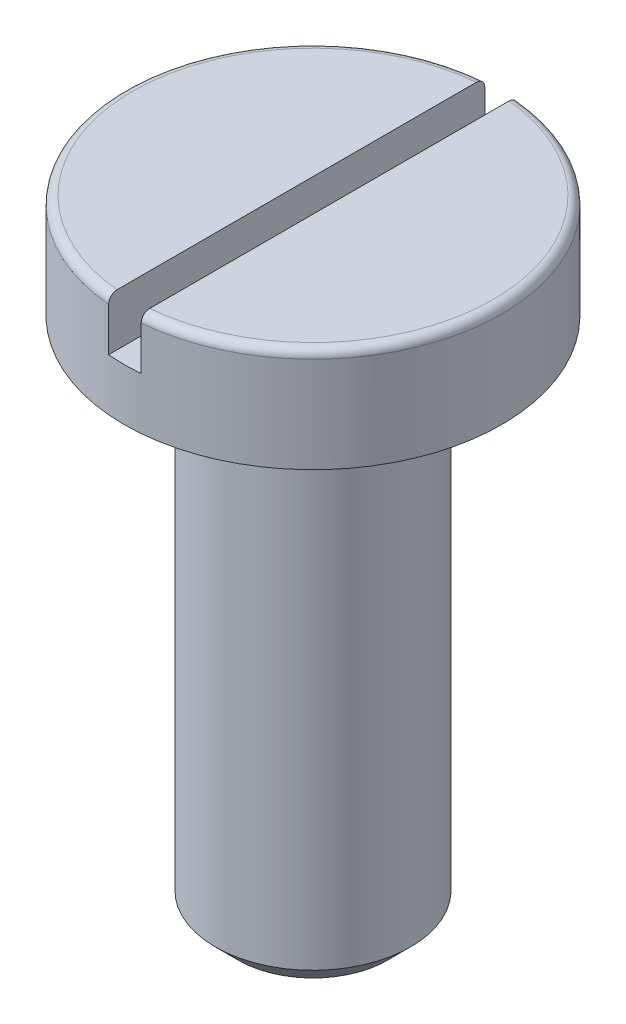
ISO-10303-21;
HEADER;
FILE_DESCRIPTION(('STEP AP214'),'2;1');
FILE_NAME('part.step','',(''),(''),'','','');
FILE_SCHEMA(('AUTOMOTIVE_DESIGN { 1 0 10303 214 1 1 1 1 }'));
ENDSEC;
DATA;
#1=APPLICATION_CONTEXT('core data for automotive mechanical design processes');
#2=APPLICATION_PROTOCOL_DEFINITION('international standard','automotive_design',2000,#1);
#3=PRODUCT_CONTEXT('',#1,'mechanical');
#4=PRODUCT('Part','Part','',(#3));
#5=PRODUCT_RELATED_PRODUCT_CATEGORY('part','',(#4));
#6=PRODUCT_DEFINITION_FORMATION('','',#4);
#7=PRODUCT_DEFINITION_CONTEXT('part definition',#1,'design');
#8=PRODUCT_DEFINITION('design','',#6,#7);
#9=PRODUCT_DEFINITION_SHAPE('','',#8);
#10=(LENGTH_UNIT() NAMED_UNIT(*) SI_UNIT(.MILLI.,.METRE.));
#11=(NAMED_UNIT(*) PLANE_ANGLE_UNIT() SI_UNIT($,.RADIAN.));
#12=(NAMED_UNIT(*) SI_UNIT($,.STERADIAN.) SOLID_ANGLE_UNIT());
#13=UNCERTAINTY_MEASURE_WITH_UNIT(LENGTH_MEASURE(1.E-05),#10,'distance_accuracy_value','');
#14=(GEOMETRIC_REPRESENTATION_CONTEXT(3) GLOBAL_UNCERTAINTY_ASSIGNED_CONTEXT((#13)) GLOBAL_UNIT_ASSIGNED_CONTEXT((#10,
#11,#12)) REPRESENTATION_CONTEXT('',''));
#15=CARTESIAN_POINT('',(0.,0.,0.));
#16=DIRECTION('',(0.,0.,1.));
#17=DIRECTION('',(1.,0.,0.));
#18=AXIS2_PLACEMENT_3D('',#15,#16,#17);
#19=CARTESIAN_POINT('',(0.,1.6,0.));
#20=DIRECTION('',(0.,-1.,0.));
#21=DIRECTION('',(0.,0.,-1.));
#22=AXIS2_PLACEMENT_3D('',#19,#20,#21);
#23=PLANE('',#22);
#24=CARTESIAN_POINT('',(0.,1.6,0.));
#25=DIRECTION('',(0.,1.,0.));
#26=DIRECTION('',(0.,0.,1.));
#27=AXIS2_PLACEMENT_3D('',#24,#25,#26);
#28=CIRCLE('',#27,2.77);
#29=CARTESIAN_POINT('',(-0.25,1.6,-2.75869534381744));
#30=VERTEX_POINT('',#29);
#31=CARTESIAN_POINT('',(-0.25,1.6,2.75869534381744));
#32=VERTEX_POINT('',#31);
#33=EDGE_CURVE('E96',#30,#32,#28,.T.);
#34=ORIENTED_EDGE('',*,*,#33,.T.);
#35=DIRECTION('',(0.,0.,1.));
#36=VECTOR('',#35,1.);
#37=CARTESIAN_POINT('',(-0.25,1.6,-2.9));
#38=LINE('',#37,#36);
#39=EDGE_CURVE('E87',#30,#32,#38,.T.);
#40=ORIENTED_EDGE('',*,*,#39,.F.);
#41=EDGE_LOOP('',(#34,#40));
#42=FACE_BOUND('',#41,.T.);
#43=ADVANCED_FACE('F33',(#42),#23,.F.);
#44=CARTESIAN_POINT('',(0.,1.47,0.));
#45=DIRECTION('',(0.,1.,0.));
#46=DIRECTION('',(0.,0.,1.));
#47=AXIS2_PLACEMENT_3D('',#44,#45,#46);
#48=TOROIDAL_SURFACE('',#47,2.77,0.13);
#49=ORIENTED_EDGE('',*,*,#33,.F.);
#50=CARTESIAN_POINT('',(-0.25,1.54312910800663,-2.86660008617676));
#51=CARTESIAN_POINT('',(-0.25,1.53711294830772,-2.87070858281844));
#52=CARTESIAN_POINT('',(-0.25,1.53074624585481,-2.87431298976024));
#53=CARTESIAN_POINT('',(-0.25,1.51749299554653,-2.88040507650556));
#54=CARTESIAN_POINT('',(-0.25,1.51060585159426,-2.88289145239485));
#55=CARTESIAN_POINT('',(-0.25,1.49651364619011,-2.88667077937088));
#56=CARTESIAN_POINT('',(-0.25,1.48930870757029,-2.88796418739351));
#57=CARTESIAN_POINT('',(-0.25,1.47478583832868,-2.88932087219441));
#58=CARTESIAN_POINT('',(-0.25,1.46746793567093,-2.88938444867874));
#59=CARTESIAN_POINT('',(-0.25,1.45293403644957,-2.8882811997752));
#60=CARTESIAN_POINT('',(-0.25,1.44571793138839,-2.88711580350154));
#61=CARTESIAN_POINT('',(-0.25,1.43158343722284,-2.88359050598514));
#62=CARTESIAN_POINT('',(-0.25,1.42466505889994,-2.88123056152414));
#63=CARTESIAN_POINT('',(-0.25,1.41131907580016,-2.87538309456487));
#64=CARTESIAN_POINT('',(-0.25,1.40489167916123,-2.87189509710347));
#65=CARTESIAN_POINT('',(-0.25,1.39271174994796,-2.86389214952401));
#66=CARTESIAN_POINT('',(-0.25,1.38695922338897,-2.85937719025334));
#67=CARTESIAN_POINT('',(-0.25,1.37627619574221,-2.84943666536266));
#68=CARTESIAN_POINT('',(-0.25,1.37134782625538,-2.84400880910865));
#69=CARTESIAN_POINT('',(-0.25,1.36246828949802,-2.83240536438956));
#70=CARTESIAN_POINT('',(-0.25,1.35851713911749,-2.82622976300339));
#71=CARTESIAN_POINT('',(-0.25,1.35168868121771,-2.81328178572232));
#72=CARTESIAN_POINT('',(-0.25,1.34881538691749,-2.80650729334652));
#73=CARTESIAN_POINT('',(-0.25,1.34424259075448,-2.79257309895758));
#74=CARTESIAN_POINT('',(-0.25,1.34254311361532,-2.78541338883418));
#75=CARTESIAN_POINT('',(-0.25,1.34036090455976,-2.77088620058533));
#76=CARTESIAN_POINT('',(-0.25,1.33988228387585,-2.76351810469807));
#77=CARTESIAN_POINT('',(-0.25,1.34016668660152,-2.74880587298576));
#78=CARTESIAN_POINT('',(-0.25,1.34092972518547,-2.74146173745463));
#79=CARTESIAN_POINT('',(-0.25,1.34367835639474,-2.72699381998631));
#80=CARTESIAN_POINT('',(-0.25,1.34566587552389,-2.71987040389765));
#81=CARTESIAN_POINT('',(-0.25,1.35080982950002,-2.70605883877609));
#82=CARTESIAN_POINT('',(-0.25,1.35396626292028,-2.69937068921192));
#83=CARTESIAN_POINT('',(-0.25,1.36135597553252,-2.68662772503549));
#84=CARTESIAN_POINT('',(-0.25,1.36558811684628,-2.68057225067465));
#85=CARTESIAN_POINT('',(-0.25,1.37501217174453,-2.669260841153));
#86=CARTESIAN_POINT('',(-0.25,1.38020406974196,-2.66400489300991));
#87=CARTESIAN_POINT('',(-0.25,1.39138176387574,-2.65446131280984));
#88=CARTESIAN_POINT('',(-0.25,1.39736480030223,-2.6501704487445));
#89=CARTESIAN_POINT('',(-0.25,1.40996883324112,-2.64265916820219));
#90=CARTESIAN_POINT('',(-0.25,1.41658981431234,-2.63943872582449));
#91=CARTESIAN_POINT('',(-0.25,1.43025138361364,-2.63417400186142));
#92=CARTESIAN_POINT('',(-0.25,1.43729005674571,-2.63212475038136));
#93=CARTESIAN_POINT('',(-0.25,1.45161198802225,-2.62924116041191));
#94=CARTESIAN_POINT('',(-0.25,1.45889524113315,-2.62840679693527));
#95=CARTESIAN_POINT('',(-0.25,1.47347542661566,-2.62797811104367));
#96=CARTESIAN_POINT('',(-0.25,1.48077224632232,-2.62837994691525));
#97=CARTESIAN_POINT('',(-0.25,1.49519466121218,-2.63040351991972));
#98=CARTESIAN_POINT('',(-0.25,1.50232025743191,-2.63202524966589));
#99=CARTESIAN_POINT('',(-0.25,1.51619554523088,-2.63644047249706));
#100=CARTESIAN_POINT('',(-0.25,1.52294537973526,-2.63923351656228));
#101=CARTESIAN_POINT('',(-0.25,1.53588196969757,-2.64591040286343));
#102=CARTESIAN_POINT('',(-0.25,1.54206871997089,-2.64979425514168));
#103=CARTESIAN_POINT('',(-0.25,1.55372078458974,-2.65855221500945));
#104=CARTESIAN_POINT('',(-0.25,1.55918424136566,-2.66342879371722));
#105=CARTESIAN_POINT('',(-0.25,1.56921910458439,-2.67402657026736));
#106=CARTESIAN_POINT('',(-0.25,1.5737904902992,-2.67974778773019));
#107=CARTESIAN_POINT('',(-0.25,1.58193168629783,-2.69189783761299));
#108=CARTESIAN_POINT('',(-0.25,1.5854972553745,-2.69832951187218));
#109=CARTESIAN_POINT('',(-0.25,1.59150274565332,-2.71169852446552));
#110=CARTESIAN_POINT('',(-0.25,1.59394263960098,-2.71863587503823));
#111=CARTESIAN_POINT('',(-0.25,1.59763652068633,-2.73284780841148));
#112=CARTESIAN_POINT('',(-0.25,1.59888594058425,-2.74012357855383));
#113=CARTESIAN_POINT('',(-0.25,1.60014789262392,-2.75478137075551));
#114=CARTESIAN_POINT('',(-0.25,1.60016045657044,-2.76216339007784));
#115=CARTESIAN_POINT('',(-0.25,1.59894723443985,-2.77683733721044));
#116=CARTESIAN_POINT('',(-0.25,1.59771939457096,-2.78412909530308));
#117=CARTESIAN_POINT('',(-0.25,1.59405541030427,-2.79840462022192));
#118=CARTESIAN_POINT('',(-0.25,1.59161896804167,-2.80538831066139));
#119=CARTESIAN_POINT('',(-0.25,1.58560742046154,-2.81884276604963));
#120=CARTESIAN_POINT('',(-0.25,1.58203280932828,-2.82531375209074));
#121=CARTESIAN_POINT('',(-0.25,1.57384692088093,-2.83755525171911));
#122=CARTESIAN_POINT('',(-0.25,1.56923690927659,-2.84332660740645));
#123=CARTESIAN_POINT('',(-0.25,1.560999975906,-2.852017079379));
#124=CARTESIAN_POINT('',(-0.25,1.5576452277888,-2.85519860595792));
#125=CARTESIAN_POINT('',(-0.25,1.55061699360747,-2.8611876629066));
#126=CARTESIAN_POINT('',(-0.25,1.54694350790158,-2.86399519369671));
#127=CARTESIAN_POINT('',(-0.25,1.54312910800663,-2.86660008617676));
#128=B_SPLINE_CURVE_WITH_KNOTS('',3,(#50,#51,#52,#53,#54,#55,#56,#57,#58,#59,#60,#61,#62,#63,
#64,#65,#66,#67,#68,#69,#70,#71,#72,#73,#74,#75,#76,#77,#78,#79,#80,#81,#82,#83,#84,#85,#86,#87,
#88,#89,#90,#91,#92,#93,#94,#95,#96,#97,#98,#99,#100,#101,#102,#103,#104,#105,#106,#107,#108,
#109,#110,#111,#112,#113,#114,#115,#116,#117,#118,#119,#120,#121,#122,#123,#124,#125,#126,#127),
.UNSPECIFIED.,.T.,.F.,(4,2,2,2,2,2,2,2,2,2,2,2,2,2,2,2,2,2,2,2,2,2,2,2,2,2,2,2,2,2,2,2,2,2,2,2,
2,2,4),(0.,0.0218387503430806,0.0437029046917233,0.0655586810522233,0.0874091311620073,
0.109234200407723,0.131060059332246,0.152895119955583,0.174730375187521,0.196621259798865,
0.218512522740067,0.240484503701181,0.262456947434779,0.284503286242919,0.306549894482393,
0.328631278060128,0.350712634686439,0.372770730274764,0.394828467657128,0.416811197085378,
0.438793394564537,0.460681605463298,0.48256936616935,0.50438917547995,0.526208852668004,
0.548020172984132,0.569831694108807,0.591698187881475,0.613565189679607,0.635523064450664,
0.657481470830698,0.679523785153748,0.701565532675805,0.723643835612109,0.745727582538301,
0.767801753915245,0.789849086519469,0.803695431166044,0.81754176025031),.UNSPECIFIED.);
#129=CARTESIAN_POINT('',(-0.25,1.47,-2.88920404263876));
#130=VERTEX_POINT('',#129);
#131=EDGE_CURVE('E84',#30,#130,#128,.T.);
#132=ORIENTED_EDGE('',*,*,#131,.T.);
#133=CARTESIAN_POINT('',(0.,1.47,0.));
#134=DIRECTION('',(0.,1.,0.));
#135=DIRECTION('',(0.,0.,1.));
#136=AXIS2_PLACEMENT_3D('',#133,#134,#135);
#137=CIRCLE('',#136,2.9);
#138=CARTESIAN_POINT('',(-0.25,1.46999999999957,2.88920404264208));
#139=VERTEX_POINT('',#138);
#140=EDGE_CURVE('E103',#130,#139,#137,.T.);
#141=ORIENTED_EDGE('',*,*,#140,.T.);
#142=CARTESIAN_POINT('',(-0.25,1.51508458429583,2.63624066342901));
#143=CARTESIAN_POINT('',(-0.25,1.50826683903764,2.63370882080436));
#144=CARTESIAN_POINT('',(-0.25,1.50123065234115,2.63175022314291));
#145=CARTESIAN_POINT('',(-0.25,1.48692355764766,2.629040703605));
#146=CARTESIAN_POINT('',(-0.25,1.47965238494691,2.62829119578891));
#147=CARTESIAN_POINT('',(-0.25,1.46509003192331,2.62802469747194));
#148=CARTESIAN_POINT('',(-0.25,1.45779886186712,2.62850716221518));
#149=CARTESIAN_POINT('',(-0.25,1.44340306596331,2.63068950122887));
#150=CARTESIAN_POINT('',(-0.25,1.43629839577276,2.63238908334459));
#151=CARTESIAN_POINT('',(-0.25,1.42247481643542,2.63695570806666));
#152=CARTESIAN_POINT('',(-0.25,1.41575590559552,2.63982274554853));
#153=CARTESIAN_POINT('',(-0.25,1.40289281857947,2.64664142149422));
#154=CARTESIAN_POINT('',(-0.25,1.39674866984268,2.65059311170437));
#155=CARTESIAN_POINT('',(-0.25,1.38519223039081,2.65947903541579));
#156=CARTESIAN_POINT('',(-0.25,1.37978187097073,2.6644157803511));
#157=CARTESIAN_POINT('',(-0.25,1.36986250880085,2.67512413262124));
#158=CARTESIAN_POINT('',(-0.25,1.36535352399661,2.68089575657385));
#159=CARTESIAN_POINT('',(-0.25,1.35734483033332,2.69313583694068));
#160=CARTESIAN_POINT('',(-0.25,1.35384941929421,2.69960710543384));
#161=CARTESIAN_POINT('',(-0.25,1.34798994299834,2.7130430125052));
#162=CARTESIAN_POINT('',(-0.25,1.34562590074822,2.7200076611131));
#163=CARTESIAN_POINT('',(-0.25,1.34208772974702,2.7342607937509));
#164=CARTESIAN_POINT('',(-0.25,1.34091810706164,2.74155039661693));
#165=CARTESIAN_POINT('',(-0.25,1.33981698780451,2.75622257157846));
#166=CARTESIAN_POINT('',(-0.25,1.33988550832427,2.76360514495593));
#167=CARTESIAN_POINT('',(-0.25,1.3412602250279,2.77826674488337));
#168=CARTESIAN_POINT('',(-0.25,1.34256849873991,2.78554557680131));
#169=CARTESIAN_POINT('',(-0.25,1.34638967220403,2.79977992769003));
#170=CARTESIAN_POINT('',(-0.25,1.34890256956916,2.80673544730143));
#171=CARTESIAN_POINT('',(-0.25,1.35506001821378,2.82011782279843));
#172=CARTESIAN_POINT('',(-0.25,1.35870344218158,2.82654519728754));
#173=CARTESIAN_POINT('',(-0.25,1.36702079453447,2.83869454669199));
#174=CARTESIAN_POINT('',(-0.25,1.37169470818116,2.84441653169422));
#175=CARTESIAN_POINT('',(-0.25,1.38192534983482,2.85497355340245));
#176=CARTESIAN_POINT('',(-0.25,1.38747932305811,2.85981125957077));
#177=CARTESIAN_POINT('',(-0.25,1.39932323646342,2.86848134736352));
#178=CARTESIAN_POINT('',(-0.25,1.40561316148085,2.8723137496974));
#179=CARTESIAN_POINT('',(-0.25,1.41872500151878,2.87884934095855));
#180=CARTESIAN_POINT('',(-0.25,1.42554482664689,2.88155672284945));
#181=CARTESIAN_POINT('',(-0.25,1.43954300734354,2.88578431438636));
#182=CARTESIAN_POINT('',(-0.25,1.44672135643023,2.88730454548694));
#183=CARTESIAN_POINT('',(-0.25,1.46121039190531,2.88911090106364));
#184=CARTESIAN_POINT('',(-0.25,1.46852063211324,2.88940060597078));
#185=CARTESIAN_POINT('',(-0.25,1.48308577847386,2.8887473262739));
#186=CARTESIAN_POINT('',(-0.25,1.49034068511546,2.88780435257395));
#187=CARTESIAN_POINT('',(-0.25,1.50458219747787,2.88471458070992));
#188=CARTESIAN_POINT('',(-0.25,1.5115690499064,2.88256891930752));
#189=CARTESIAN_POINT('',(-0.25,1.52508407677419,2.87713661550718));
#190=CARTESIAN_POINT('',(-0.25,1.53161224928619,2.8738499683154));
#191=CARTESIAN_POINT('',(-0.25,1.54403468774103,2.86622498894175));
#192=CARTESIAN_POINT('',(-0.25,1.54992807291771,2.86188522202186));
#193=CARTESIAN_POINT('',(-0.25,1.56090550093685,2.85228075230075));
#194=CARTESIAN_POINT('',(-0.25,1.56598953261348,2.84701603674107));
#195=CARTESIAN_POINT('',(-0.25,1.57522144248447,2.83569355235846));
#196=CARTESIAN_POINT('',(-0.25,1.57936630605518,2.8296333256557));
#197=CARTESIAN_POINT('',(-0.25,1.58658422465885,2.8169050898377));
#198=CARTESIAN_POINT('',(-0.25,1.58965725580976,2.81023706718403));
#199=CARTESIAN_POINT('',(-0.25,1.59465619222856,2.79645576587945));
#200=CARTESIAN_POINT('',(-0.25,1.59657776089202,2.78934091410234));
#201=CARTESIAN_POINT('',(-0.25,1.59920285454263,2.77488991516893));
#202=CARTESIAN_POINT('',(-0.25,1.59990635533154,2.76755376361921));
#203=CARTESIAN_POINT('',(-0.25,1.6000763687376,2.75284646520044));
#204=CARTESIAN_POINT('',(-0.25,1.59953940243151,2.74547527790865));
#205=CARTESIAN_POINT('',(-0.25,1.59723636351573,2.73092770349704));
#206=CARTESIAN_POINT('',(-0.25,1.59547032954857,2.72375131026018));
#207=CARTESIAN_POINT('',(-0.25,1.59075732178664,2.70979378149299));
#208=CARTESIAN_POINT('',(-0.25,1.58780982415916,2.70301282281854));
#209=CARTESIAN_POINT('',(-0.25,1.58081499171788,2.69004163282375));
#210=CARTESIAN_POINT('',(-0.25,1.57676739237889,2.68385154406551));
#211=CARTESIAN_POINT('',(-0.25,1.56769463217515,2.67225212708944));
#212=CARTESIAN_POINT('',(-0.25,1.56267108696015,2.66684153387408));
#213=CARTESIAN_POINT('',(-0.25,1.55178722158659,2.65695006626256));
#214=CARTESIAN_POINT('',(-0.25,1.54592793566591,2.65246805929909));
#215=CARTESIAN_POINT('',(-0.25,1.53586022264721,2.64603954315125));
#216=CARTESIAN_POINT('',(-0.25,1.53185325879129,2.64377147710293));
#217=CARTESIAN_POINT('',(-0.25,1.5236215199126,2.6396727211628));
#218=CARTESIAN_POINT('',(-0.25,1.51939674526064,2.63784203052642));
#219=CARTESIAN_POINT('',(-0.25,1.51508458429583,2.63624066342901));
#220=B_SPLINE_CURVE_WITH_KNOTS('',3,(#142,#143,#144,#145,#146,#147,#148,#149,#150,#151,#152,
#153,#154,#155,#156,#157,#158,#159,#160,#161,#162,#163,#164,#165,#166,#167,#168,#169,#170,#171,
#172,#173,#174,#175,#176,#177,#178,#179,#180,#181,#182,#183,#184,#185,#186,#187,#188,#189,#190,
#191,#192,#193,#194,#195,#196,#197,#198,#199,#200,#201,#202,#203,#204,#205,#206,#207,#208,#209,
#210,#211,#212,#213,#214,#215,#216,#217,#218,#219),.UNSPECIFIED.,.T.,.F.,(4,2,2,2,2,2,2,2,2,2,2,
2,2,2,2,2,2,2,2,2,2,2,2,2,2,2,2,2,2,2,2,2,2,2,2,2,2,2,4),(0.,0.0218012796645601,
0.0436280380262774,0.0654451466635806,0.08725702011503,0.109068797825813,0.130881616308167,
0.1527507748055,0.174620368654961,0.196581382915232,0.218542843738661,0.240586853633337,
0.262631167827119,0.284712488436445,0.306793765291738,0.328853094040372,0.35091210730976,
0.372903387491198,0.394894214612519,0.416802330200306,0.438710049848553,0.460553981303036,
0.482397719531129,0.504220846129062,0.52604406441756,0.547897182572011,0.569750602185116,
0.591673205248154,0.613596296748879,0.635601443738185,0.657607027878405,0.679674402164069,
0.701741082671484,0.723817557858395,0.745899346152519,0.767944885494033,0.789963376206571,
0.803752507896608,0.817541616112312),.UNSPECIFIED.);
#221=EDGE_CURVE('E93',#139,#32,#220,.T.);
#222=ORIENTED_EDGE('',*,*,#221,.T.);
#223=EDGE_LOOP('',(#49,#132,#141,#222));
#224=FACE_BOUND('',#223,.T.);
#225=ADVANCED_FACE('F99',(#224),#48,.T.);
#226=CARTESIAN_POINT('',(0.,-8.,0.));
#227=DIRECTION('',(0.,1.,0.));
#228=DIRECTION('',(0.,0.,1.));
#229=AXIS2_PLACEMENT_3D('',#226,#227,#228);
#230=CYLINDRICAL_SURFACE('',#229,1.5);
#231=CARTESIAN_POINT('',(0.,-7.64999999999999,0.));
#232=DIRECTION('',(0.,1.,0.));
#233=DIRECTION('',(0.,0.,1.));
#234=AXIS2_PLACEMENT_3D('',#231,#232,#233);
#235=CIRCLE('',#234,1.5);
#236=CARTESIAN_POINT('',(0.,-7.64999999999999,1.5));
#237=VERTEX_POINT('',#236);
#238=EDGE_CURVE('E116',#237,#237,#235,.T.);
#239=ORIENTED_EDGE('',*,*,#238,.T.);
#240=EDGE_LOOP('',(#239));
#241=FACE_BOUND('',#240,.T.);
#242=CARTESIAN_POINT('',(0.,0.,0.));
#243=DIRECTION('',(0.,1.,0.));
#244=DIRECTION('',(0.,0.,1.));
#245=AXIS2_PLACEMENT_3D('',#242,#243,#244);
#246=CIRCLE('',#245,1.5);
#247=CARTESIAN_POINT('',(0.,0.,1.5));
#248=VERTEX_POINT('',#247);
#249=EDGE_CURVE('E113',#248,#248,#246,.T.);
#250=ORIENTED_EDGE('',*,*,#249,.F.);
#251=EDGE_LOOP('',(#250));
#252=FACE_BOUND('',#251,.T.);
#253=ADVANCED_FACE('F184',(#241,#252),#230,.T.);
#254=CARTESIAN_POINT('',(0.,-8.,0.));
#255=DIRECTION('',(0.,1.,0.));
#256=DIRECTION('',(0.,0.,1.));
#257=AXIS2_PLACEMENT_3D('',#254,#255,#256);
#258=PLANE('',#257);
#259=CARTESIAN_POINT('',(0.,-8.,0.));
#260=DIRECTION('',(0.,1.,0.));
#261=DIRECTION('',(0.,0.,1.));
#262=AXIS2_PLACEMENT_3D('',#259,#260,#261);
#263=CIRCLE('',#262,1.15);
#264=CARTESIAN_POINT('',(0.,-8.,1.15));
#265=VERTEX_POINT('',#264);
#266=EDGE_CURVE('E119',#265,#265,#263,.F.);
#267=ORIENTED_EDGE('',*,*,#266,.T.);
#268=EDGE_LOOP('',(#267));
#269=FACE_BOUND('',#268,.T.);
#270=ADVANCED_FACE('F194',(#269),#258,.F.);
#271=CARTESIAN_POINT('',(0.,-7.64999999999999,0.));
#272=DIRECTION('',(0.,1.,0.));
#273=DIRECTION('',(0.,0.,1.));
#274=AXIS2_PLACEMENT_3D('',#271,#272,#273);
#275=CONICAL_SURFACE('',#274,1.5,0.785398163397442);
#276=ORIENTED_EDGE('',*,*,#266,.F.);
#277=EDGE_LOOP('',(#276));
#278=FACE_BOUND('',#277,.T.);
#279=ORIENTED_EDGE('',*,*,#238,.F.);
#280=EDGE_LOOP('',(#279));
#281=FACE_BOUND('',#280,.T.);
#282=ADVANCED_FACE('F35',(#278,#281),#275,.T.);
#283=CARTESIAN_POINT('',(0.25,1.6,2.75869534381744));
#284=VERTEX_POINT('',#283);
#285=CARTESIAN_POINT('',(0.25,1.6,-2.75869534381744));
#286=VERTEX_POINT('',#285);
#287=EDGE_CURVE('E100',#284,#286,#28,.T.);
#288=ORIENTED_EDGE('',*,*,#287,.T.);
#289=DIRECTION('',(0.,0.,-1.));
#290=VECTOR('',#289,1.);
#291=CARTESIAN_POINT('',(0.25,1.6,-2.9));
#292=LINE('',#291,#290);
#293=EDGE_CURVE('E97',#284,#286,#292,.T.);
#294=ORIENTED_EDGE('',*,*,#293,.F.);
#295=EDGE_LOOP('',(#288,#294));
#296=FACE_BOUND('',#295,.T.);
#297=ADVANCED_FACE('F158',(#296),#23,.F.);
#298=CARTESIAN_POINT('',(0.,0.,0.));
#299=DIRECTION('',(0.,1.,0.));
#300=DIRECTION('',(0.,0.,1.));
#301=AXIS2_PLACEMENT_3D('',#298,#299,#300);
#302=PLANE('',#301);
#303=ORIENTED_EDGE('',*,*,#249,.T.);
#304=EDGE_LOOP('',(#303));
#305=FACE_BOUND('',#304,.T.);
#306=CARTESIAN_POINT('',(0.,0.,0.));
#307=DIRECTION('',(0.,1.,0.));
#308=DIRECTION('',(0.,0.,1.));
#309=AXIS2_PLACEMENT_3D('',#306,#307,#308);
#310=CIRCLE('',#309,2.9);
#311=CARTESIAN_POINT('',(0.,0.,2.9));
#312=VERTEX_POINT('',#311);
#313=EDGE_CURVE('E110',#312,#312,#310,.T.);
#314=ORIENTED_EDGE('',*,*,#313,.F.);
#315=EDGE_LOOP('',(#314));
#316=FACE_BOUND('',#315,.T.);
#317=ADVANCED_FACE('F188',(#305,#316),#302,.F.);
#318=CARTESIAN_POINT('',(0.,1.3,0.));
#319=DIRECTION('',(0.,1.,0.));
#320=DIRECTION('',(0.,0.,1.));
#321=AXIS2_PLACEMENT_3D('',#318,#319,#320);
#322=CYLINDRICAL_SURFACE('',#321,2.9);
#323=ORIENTED_EDGE('',*,*,#140,.F.);
#324=DIRECTION('',(0.,1.,0.));
#325=VECTOR('',#324,1.);
#326=CARTESIAN_POINT('',(-0.25,1.3,-2.88920404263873));
#327=LINE('',#326,#325);
#328=CARTESIAN_POINT('',(-0.25,0.8,-2.88920404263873));
#329=VERTEX_POINT('',#328);
#330=EDGE_CURVE('E56',#130,#329,#327,.F.);
#331=ORIENTED_EDGE('',*,*,#330,.T.);
#332=CARTESIAN_POINT('',(0.,0.8,0.));
#333=DIRECTION('',(0.,1.,0.));
#334=DIRECTION('',(0.,0.,1.));
#335=AXIS2_PLACEMENT_3D('',#332,#333,#334);
#336=CIRCLE('',#335,2.9);
#337=CARTESIAN_POINT('',(0.25,0.8,-2.88920404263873));
#338=VERTEX_POINT('',#337);
#339=EDGE_CURVE('E11',#338,#329,#336,.T.);
#340=ORIENTED_EDGE('',*,*,#339,.F.);
#341=DIRECTION('',(0.,1.,0.));
#342=VECTOR('',#341,1.);
#343=CARTESIAN_POINT('',(0.25,1.3,-2.88920404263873));
#344=LINE('',#343,#342);
#345=CARTESIAN_POINT('',(0.25,1.47,-2.88920404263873));
#346=VERTEX_POINT('',#345);
#347=EDGE_CURVE('E167',#338,#346,#344,.T.);
#348=ORIENTED_EDGE('',*,*,#347,.T.);
#349=CARTESIAN_POINT('',(0.25,1.47,2.88920404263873));
#350=VERTEX_POINT('',#349);
#351=EDGE_CURVE('E109',#350,#346,#137,.T.);
#352=ORIENTED_EDGE('',*,*,#351,.F.);
#353=DIRECTION('',(0.,1.,0.));
#354=VECTOR('',#353,1.);
#355=CARTESIAN_POINT('',(0.25,1.3,2.88920404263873));
#356=LINE('',#355,#354);
#357=CARTESIAN_POINT('',(0.25,0.8,2.88920404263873));
#358=VERTEX_POINT('',#357);
#359=EDGE_CURVE('E48',#350,#358,#356,.F.);
#360=ORIENTED_EDGE('',*,*,#359,.T.);
#361=CARTESIAN_POINT('',(-0.25,0.8,2.88920404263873));
#362=VERTEX_POINT('',#361);
#363=EDGE_CURVE('E37',#362,#358,#336,.T.);
#364=ORIENTED_EDGE('',*,*,#363,.F.);
#365=DIRECTION('',(0.,1.,0.));
#366=VECTOR('',#365,1.);
#367=CARTESIAN_POINT('',(-0.25,1.3,2.88920404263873));
#368=LINE('',#367,#366);
#369=EDGE_CURVE('E104',#362,#139,#368,.T.);
#370=ORIENTED_EDGE('',*,*,#369,.T.);
#371=EDGE_LOOP('',(#323,#331,#340,#348,#352,#360,#364,#370));
#372=FACE_BOUND('',#371,.T.);
#373=ORIENTED_EDGE('',*,*,#313,.T.);
#374=EDGE_LOOP('',(#373));
#375=FACE_BOUND('',#374,.T.);
#376=ADVANCED_FACE('F171',(#372,#375),#322,.T.);
#377=ORIENTED_EDGE('',*,*,#351,.T.);
#378=CARTESIAN_POINT('',(0.25,1.54312910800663,-2.86660008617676));
#379=CARTESIAN_POINT('',(0.25,1.5491745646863,-2.86247079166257));
#380=CARTESIAN_POINT('',(0.25,1.55487479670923,-2.85782639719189));
#381=CARTESIAN_POINT('',(0.25,1.56541834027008,-2.84764165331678));
#382=CARTESIAN_POINT('',(0.25,1.5702605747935,-2.84210019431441));
#383=CARTESIAN_POINT('',(0.25,1.57894407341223,-2.83028661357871));
#384=CARTESIAN_POINT('',(0.25,1.58278597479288,-2.82401496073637));
#385=CARTESIAN_POINT('',(0.25,1.58936447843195,-2.81091882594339));
#386=CARTESIAN_POINT('',(0.25,1.59210135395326,-2.80409448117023));
#387=CARTESIAN_POINT('',(0.25,1.5964020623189,-2.790064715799));
#388=CARTESIAN_POINT('',(0.25,1.59796259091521,-2.78285828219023));
#389=CARTESIAN_POINT('',(0.25,1.59985507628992,-2.76828554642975));
#390=CARTESIAN_POINT('',(0.25,1.60018696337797,-2.7609192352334));
#391=CARTESIAN_POINT('',(0.25,1.59961237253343,-2.7462165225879));
#392=CARTESIAN_POINT('',(0.25,1.59870279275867,-2.73888024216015));
#393=CARTESIAN_POINT('',(0.25,1.5956651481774,-2.72446438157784));
#394=CARTESIAN_POINT('',(0.25,1.59353707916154,-2.71738480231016));
#395=CARTESIAN_POINT('',(0.25,1.5881212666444,-2.70368272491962));
#396=CARTESIAN_POINT('',(0.25,1.58483335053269,-2.697060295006));
#397=CARTESIAN_POINT('',(0.25,1.5771897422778,-2.68446326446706));
#398=CARTESIAN_POINT('',(0.25,1.5728340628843,-2.6784886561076));
#399=CARTESIAN_POINT('',(0.25,1.56318940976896,-2.66737336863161));
#400=CARTESIAN_POINT('',(0.25,1.55790277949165,-2.66223065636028));
#401=CARTESIAN_POINT('',(0.25,1.54653803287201,-2.6529102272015));
#402=CARTESIAN_POINT('',(0.25,1.54045993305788,-2.64873249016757));
#403=CARTESIAN_POINT('',(0.25,1.52771160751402,-2.64147908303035));
#404=CARTESIAN_POINT('',(0.25,1.52104393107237,-2.6383989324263));
#405=CARTESIAN_POINT('',(0.25,1.50728476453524,-2.63340672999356));
#406=CARTESIAN_POINT('',(0.25,1.50019328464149,-2.63149465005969));
#407=CARTESIAN_POINT('',(0.25,1.48581726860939,-2.62889978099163));
#408=CARTESIAN_POINT('',(0.25,1.47853358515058,-2.62821226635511));
#409=CARTESIAN_POINT('',(0.25,1.46395439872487,-2.62807213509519));
#410=CARTESIAN_POINT('',(0.25,1.45665889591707,-2.62861950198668));
#411=CARTESIAN_POINT('',(0.25,1.44227612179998,-2.63093109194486));
#412=CARTESIAN_POINT('',(0.25,1.43518851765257,-2.63269324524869));
#413=CARTESIAN_POINT('',(0.25,1.42140916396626,-2.63738092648));
#414=CARTESIAN_POINT('',(0.25,1.41471741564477,-2.64030645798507));
#415=CARTESIAN_POINT('',(0.25,1.40190964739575,-2.64724085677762));
#416=CARTESIAN_POINT('',(0.25,1.3957943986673,-2.65125114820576));
#417=CARTESIAN_POINT('',(0.25,1.38432079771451,-2.66023796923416));
#418=CARTESIAN_POINT('',(0.25,1.37896245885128,-2.66521451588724));
#419=CARTESIAN_POINT('',(0.25,1.36913350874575,-2.67601176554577));
#420=CARTESIAN_POINT('',(0.25,1.36466621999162,-2.68183549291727));
#421=CARTESIAN_POINT('',(0.25,1.35676790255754,-2.69414768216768));
#422=CARTESIAN_POINT('',(0.25,1.35333689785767,-2.70063615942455));
#423=CARTESIAN_POINT('',(0.25,1.34759368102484,-2.71412303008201));
#424=CARTESIAN_POINT('',(0.25,1.34528623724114,-2.72112345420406));
#425=CARTESIAN_POINT('',(0.25,1.34187564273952,-2.73541179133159));
#426=CARTESIAN_POINT('',(0.25,1.34077251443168,-2.74269970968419));
#427=CARTESIAN_POINT('',(0.25,1.33979982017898,-2.75737809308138));
#428=CARTESIAN_POINT('',(0.25,1.33993373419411,-2.7647687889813));
#429=CARTESIAN_POINT('',(0.25,1.34144003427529,-2.77942292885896));
#430=CARTESIAN_POINT('',(0.25,1.3428124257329,-2.78668637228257));
#431=CARTESIAN_POINT('',(0.25,1.34675838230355,-2.80088148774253));
#432=CARTESIAN_POINT('',(0.25,1.3493322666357,-2.80781307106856));
#433=CARTESIAN_POINT('',(0.25,1.3556097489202,-2.82114436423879));
#434=CARTESIAN_POINT('',(0.25,1.35931333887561,-2.82754407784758));
#435=CARTESIAN_POINT('',(0.25,1.36773694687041,-2.83961421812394));
#436=CARTESIAN_POINT('',(0.25,1.37245468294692,-2.84528623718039));
#437=CARTESIAN_POINT('',(0.25,1.38277860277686,-2.85575413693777));
#438=CARTESIAN_POINT('',(0.25,1.38838477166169,-2.86055003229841));
#439=CARTESIAN_POINT('',(0.25,1.40030477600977,-2.86911096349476));
#440=CARTESIAN_POINT('',(0.25,1.40661598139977,-2.87287966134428));
#441=CARTESIAN_POINT('',(0.25,1.41978296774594,-2.87929953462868));
#442=CARTESIAN_POINT('',(0.25,1.42663871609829,-2.88195077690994));
#443=CARTESIAN_POINT('',(0.25,1.44067384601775,-2.88605130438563));
#444=CARTESIAN_POINT('',(0.25,1.447851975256,-2.88750487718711));
#445=CARTESIAN_POINT('',(0.25,1.46235242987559,-2.88918389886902));
#446=CARTESIAN_POINT('',(0.25,1.46967478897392,-2.88940905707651));
#447=CARTESIAN_POINT('',(0.25,1.48424138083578,-2.88862494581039));
#448=CARTESIAN_POINT('',(0.25,1.49148571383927,-2.8876175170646));
#449=CARTESIAN_POINT('',(0.25,1.50569606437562,-2.88440083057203));
#450=CARTESIAN_POINT('',(0.25,1.51266240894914,-2.88219303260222));
#451=CARTESIAN_POINT('',(0.25,1.52355590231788,-2.87770261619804));
#452=CARTESIAN_POINT('',(0.25,1.52763032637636,-2.87576853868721));
#453=CARTESIAN_POINT('',(0.25,1.53555646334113,-2.87148804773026));
#454=CARTESIAN_POINT('',(0.25,1.53940817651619,-2.86914163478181));
#455=CARTESIAN_POINT('',(0.25,1.54312910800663,-2.86660008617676));
#456=B_SPLINE_CURVE_WITH_KNOTS('',3,(#378,#379,#380,#381,#382,#383,#384,#385,#386,#387,#388,
#389,#390,#391,#392,#393,#394,#395,#396,#397,#398,#399,#400,#401,#402,#403,#404,#405,#406,#407,
#408,#409,#410,#411,#412,#413,#414,#415,#416,#417,#418,#419,#420,#421,#422,#423,#424,#425,#426,
#427,#428,#429,#430,#431,#432,#433,#434,#435,#436,#437,#438,#439,#440,#441,#442,#443,#444,#445,
#446,#447,#448,#449,#450,#451,#452,#453,#454,#455),.UNSPECIFIED.,.T.,.F.,(4,2,2,2,2,2,2,2,2,2,2,
2,2,2,2,2,2,2,2,2,2,2,2,2,2,2,2,2,2,2,2,2,2,2,2,2,2,2,4),(0.,0.0219467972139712,
0.0439209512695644,0.065881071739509,0.0878357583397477,0.109851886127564,0.131869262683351,
0.153941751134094,0.17601431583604,0.198090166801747,0.220165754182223,0.242186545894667,
0.264206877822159,0.286136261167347,0.308065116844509,0.329909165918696,0.351752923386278,
0.373559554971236,0.395366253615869,0.417201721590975,0.439037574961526,0.460953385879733,
0.482869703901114,0.504878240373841,0.526887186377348,0.548958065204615,0.571029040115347,
0.593105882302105,0.615182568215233,0.637210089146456,0.659237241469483,0.681184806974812,
0.703131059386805,0.724998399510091,0.74687091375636,0.768710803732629,0.79052419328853,
0.804032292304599,0.817540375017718),.UNSPECIFIED.);
#457=EDGE_CURVE('E128',#346,#286,#456,.T.);
#458=ORIENTED_EDGE('',*,*,#457,.T.);
#459=ORIENTED_EDGE('',*,*,#287,.F.);
#460=CARTESIAN_POINT('',(0.25,1.51508458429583,2.63624066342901));
#461=CARTESIAN_POINT('',(0.25,1.52193089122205,2.63878381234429));
#462=CARTESIAN_POINT('',(0.25,1.52856686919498,2.64190877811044));
#463=CARTESIAN_POINT('',(0.25,1.54122460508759,2.64923246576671));
#464=CARTESIAN_POINT('',(0.25,1.54724559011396,2.65343251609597));
#465=CARTESIAN_POINT('',(0.25,1.55849414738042,2.66278069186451));
#466=CARTESIAN_POINT('',(0.25,1.56372223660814,2.66792819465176));
#467=CARTESIAN_POINT('',(0.25,1.57324175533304,2.67902397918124));
#468=CARTESIAN_POINT('',(0.25,1.57753341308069,2.68497206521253));
#469=CARTESIAN_POINT('',(0.25,1.58507533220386,2.69752141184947));
#470=CARTESIAN_POINT('',(0.25,1.5883222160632,2.70412470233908));
#471=CARTESIAN_POINT('',(0.25,1.59366598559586,2.71778157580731));
#472=CARTESIAN_POINT('',(0.25,1.59576280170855,2.72483518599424));
#473=CARTESIAN_POINT('',(0.25,1.59875370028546,2.73921932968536));
#474=CARTESIAN_POINT('',(0.25,1.5996434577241,2.74655076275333));
#475=CARTESIAN_POINT('',(0.25,1.60018139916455,2.76125907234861));
#476=CARTESIAN_POINT('',(0.25,1.59982957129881,2.76863594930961));
#477=CARTESIAN_POINT('',(0.25,1.5978924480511,2.78323641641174));
#478=CARTESIAN_POINT('',(0.25,1.59630544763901,2.79045978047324));
#479=CARTESIAN_POINT('',(0.25,1.59193975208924,2.80453698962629));
#480=CARTESIAN_POINT('',(0.25,1.58916106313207,2.81139083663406));
#481=CARTESIAN_POINT('',(0.25,1.58249371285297,2.82452456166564));
#482=CARTESIAN_POINT('',(0.25,1.57860647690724,2.83080516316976));
#483=CARTESIAN_POINT('',(0.25,1.56982953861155,2.84262186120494));
#484=CARTESIAN_POINT('',(0.25,1.56493985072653,2.8481579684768));
#485=CARTESIAN_POINT('',(0.25,1.55431343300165,2.85830913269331));
#486=CARTESIAN_POINT('',(0.25,1.54857948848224,2.86292710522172));
#487=CARTESIAN_POINT('',(0.25,1.53641526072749,2.87113055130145));
#488=CARTESIAN_POINT('',(0.25,1.52998499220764,2.87471604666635));
#489=CARTESIAN_POINT('',(0.25,1.51663650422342,2.8807388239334));
#490=CARTESIAN_POINT('',(0.25,1.5097201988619,2.88318034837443));
#491=CARTESIAN_POINT('',(0.25,1.49557525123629,2.886864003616));
#492=CARTESIAN_POINT('',(0.25,1.48834661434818,2.88810615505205));
#493=CARTESIAN_POINT('',(0.25,1.47380335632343,2.88935317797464));
#494=CARTESIAN_POINT('',(0.25,1.46648902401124,2.88936142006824));
#495=CARTESIAN_POINT('',(0.25,1.45196300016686,2.88814886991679));
#496=CARTESIAN_POINT('',(0.25,1.44475130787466,2.88692808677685));
#497=CARTESIAN_POINT('',(0.25,1.43064019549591,2.88329416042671));
#498=CARTESIAN_POINT('',(0.25,1.42374056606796,2.88088182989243));
#499=CARTESIAN_POINT('',(0.25,1.4104433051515,2.87493487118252));
#500=CARTESIAN_POINT('',(0.25,1.40404567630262,2.87140023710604));
#501=CARTESIAN_POINT('',(0.25,1.39192244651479,2.86330365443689));
#502=CARTESIAN_POINT('',(0.25,1.38619794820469,2.85874005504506));
#503=CARTESIAN_POINT('',(0.25,1.37559322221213,2.84871945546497));
#504=CARTESIAN_POINT('',(0.25,1.37071300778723,2.84326244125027));
#505=CARTESIAN_POINT('',(0.25,1.36191791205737,2.83159084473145));
#506=CARTESIAN_POINT('',(0.25,1.3580062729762,2.8253738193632));
#507=CARTESIAN_POINT('',(0.25,1.35127777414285,2.81237318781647));
#508=CARTESIAN_POINT('',(0.25,1.34846093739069,2.80558956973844));
#509=CARTESIAN_POINT('',(0.25,1.34399128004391,2.79162128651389));
#510=CARTESIAN_POINT('',(0.25,1.34234282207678,2.78443522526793));
#511=CARTESIAN_POINT('',(0.25,1.3402722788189,2.7698885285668));
#512=CARTESIAN_POINT('',(0.25,1.3398502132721,2.76252789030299));
#513=CARTESIAN_POINT('',(0.25,1.3402443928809,2.74782070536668));
#514=CARTESIAN_POINT('',(0.25,1.34106384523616,2.74047424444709));
#515=CARTESIAN_POINT('',(0.25,1.34392409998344,2.72602297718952));
#516=CARTESIAN_POINT('',(0.25,1.34596491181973,2.71891817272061));
#517=CARTESIAN_POINT('',(0.25,1.35121175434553,2.70515060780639));
#518=CARTESIAN_POINT('',(0.25,1.35441806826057,2.69848795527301));
#519=CARTESIAN_POINT('',(0.25,1.36190632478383,2.68579722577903));
#520=CARTESIAN_POINT('',(0.25,1.36618825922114,2.67976914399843));
#521=CARTESIAN_POINT('',(0.25,1.37569606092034,2.6685346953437));
#522=CARTESIAN_POINT('',(0.25,1.38091965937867,2.66332640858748));
#523=CARTESIAN_POINT('',(0.25,1.39217007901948,2.65386532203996));
#524=CARTESIAN_POINT('',(0.25,1.39819685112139,2.64961246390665));
#525=CARTESIAN_POINT('',(0.25,1.41085558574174,2.64220176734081));
#526=CARTESIAN_POINT('',(0.25,1.417484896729,2.63903939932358));
#527=CARTESIAN_POINT('',(0.25,1.43118363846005,2.63387678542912));
#528=CARTESIAN_POINT('',(0.25,1.43825316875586,2.6318768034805));
#529=CARTESIAN_POINT('',(0.25,1.45260291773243,2.62910348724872));
#530=CARTESIAN_POINT('',(0.25,1.4598823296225,2.62832596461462));
#531=CARTESIAN_POINT('',(0.25,1.47446198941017,2.62800827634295));
#532=CARTESIAN_POINT('',(0.25,1.4817622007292,2.62846659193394));
#533=CARTESIAN_POINT('',(0.25,1.49342192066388,2.63019333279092));
#534=CARTESIAN_POINT('',(0.25,1.49784049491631,2.63108585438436));
#535=CARTESIAN_POINT('',(0.25,1.5065609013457,2.63332538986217));
#536=CARTESIAN_POINT('',(0.25,1.51086273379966,2.63467240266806));
#537=CARTESIAN_POINT('',(0.25,1.51508458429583,2.63624066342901));
#538=B_SPLINE_CURVE_WITH_KNOTS('',3,(#460,#461,#462,#463,#464,#465,#466,#467,#468,#469,#470,
#471,#472,#473,#474,#475,#476,#477,#478,#479,#480,#481,#482,#483,#484,#485,#486,#487,#488,#489,
#490,#491,#492,#493,#494,#495,#496,#497,#498,#499,#500,#501,#502,#503,#504,#505,#506,#507,#508,
#509,#510,#511,#512,#513,#514,#515,#516,#517,#518,#519,#520,#521,#522,#523,#524,#525,#526,#527,
#528,#529,#530,#531,#532,#533,#534,#535,#536,#537),.UNSPECIFIED.,.T.,.F.,(4,2,2,2,2,2,2,2,2,2,2,
2,2,2,2,2,2,2,2,2,2,2,2,2,2,2,2,2,2,2,2,2,2,2,2,2,2,2,4),(0.,0.0218936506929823,
0.0438144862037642,0.0657209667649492,0.0876221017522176,0.109593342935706,0.131565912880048,
0.153617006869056,0.175668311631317,0.197750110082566,0.219831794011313,0.241885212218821,
0.263938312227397,0.285920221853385,0.30790166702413,0.32980093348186,0.351699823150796,
0.373538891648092,0.39537779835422,0.417201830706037,0.439025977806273,0.460885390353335,
0.482745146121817,0.504677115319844,0.526609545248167,0.548623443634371,0.570637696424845,
0.592708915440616,0.61478030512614,0.636857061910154,0.658933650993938,0.680957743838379,
0.702980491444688,0.724910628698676,0.746845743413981,0.768705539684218,0.790538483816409,
0.804039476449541,0.81754043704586),.UNSPECIFIED.);
#539=EDGE_CURVE('E122',#284,#350,#538,.T.);
#540=ORIENTED_EDGE('',*,*,#539,.T.);
#541=EDGE_LOOP('',(#377,#458,#459,#540));
#542=FACE_BOUND('',#541,.T.);
#543=ADVANCED_FACE('F132',(#542),#48,.T.);
#544=CARTESIAN_POINT('',(-0.25,0.8,2.9));
#545=DIRECTION('',(0.,1.,0.));
#546=DIRECTION('',(0.,0.,1.));
#547=AXIS2_PLACEMENT_3D('',#544,#545,#546);
#548=PLANE('',#547);
#549=DIRECTION('',(0.,0.,-1.));
#550=VECTOR('',#549,1.);
#551=CARTESIAN_POINT('',(0.25,0.8,-2.9));
#552=LINE('',#551,#550);
#553=EDGE_CURVE('E162',#358,#338,#552,.T.);
#554=ORIENTED_EDGE('',*,*,#553,.T.);
#555=ORIENTED_EDGE('',*,*,#339,.T.);
#556=DIRECTION('',(0.,0.,1.));
#557=VECTOR('',#556,1.);
#558=CARTESIAN_POINT('',(-0.25,0.8,-2.9));
#559=LINE('',#558,#557);
#560=EDGE_CURVE('E159',#329,#362,#559,.T.);
#561=ORIENTED_EDGE('',*,*,#560,.T.);
#562=ORIENTED_EDGE('',*,*,#363,.T.);
#563=EDGE_LOOP('',(#554,#555,#561,#562));
#564=FACE_BOUND('',#563,.T.);
#565=ADVANCED_FACE('F140',(#564),#548,.T.);
#566=CARTESIAN_POINT('',(-0.25,0.8,-2.9));
#567=DIRECTION('',(-1.,0.,0.));
#568=DIRECTION('',(0.,0.,1.));
#569=AXIS2_PLACEMENT_3D('',#566,#567,#568);
#570=PLANE('',#569);
#571=ORIENTED_EDGE('',*,*,#131,.F.);
#572=ORIENTED_EDGE('',*,*,#39,.T.);
#573=ORIENTED_EDGE('',*,*,#221,.F.);
#574=ORIENTED_EDGE('',*,*,#369,.F.);
#575=ORIENTED_EDGE('',*,*,#560,.F.);
#576=ORIENTED_EDGE('',*,*,#330,.F.);
#577=EDGE_LOOP('',(#571,#572,#573,#574,#575,#576));
#578=FACE_BOUND('',#577,.T.);
#579=ADVANCED_FACE('F86',(#578),#570,.F.);
#580=CARTESIAN_POINT('',(0.25,0.8,-2.9));
#581=DIRECTION('',(1.,0.,0.));
#582=DIRECTION('',(0.,0.,-1.));
#583=AXIS2_PLACEMENT_3D('',#580,#581,#582);
#584=PLANE('',#583);
#585=ORIENTED_EDGE('',*,*,#553,.F.);
#586=ORIENTED_EDGE('',*,*,#359,.F.);
#587=ORIENTED_EDGE('',*,*,#539,.F.);
#588=ORIENTED_EDGE('',*,*,#293,.T.);
#589=ORIENTED_EDGE('',*,*,#457,.F.);
#590=ORIENTED_EDGE('',*,*,#347,.F.);
#591=EDGE_LOOP('',(#585,#586,#587,#588,#589,#590));
#592=FACE_BOUND('',#591,.T.);
#593=ADVANCED_FACE('F136',(#592),#584,.F.);
#594=CLOSED_SHELL('',(#43,#225,#253,#270,#282,#297,#317,#376,#543,#565,#579,#593));
#595=MANIFOLD_SOLID_BREP('B2',#594);
#596=ADVANCED_BREP_SHAPE_REPRESENTATION('',(#18,#595),#14);
#597=SHAPE_DEFINITION_REPRESENTATION(#9,#596);
ENDSEC;
END-ISO-10303-21;
